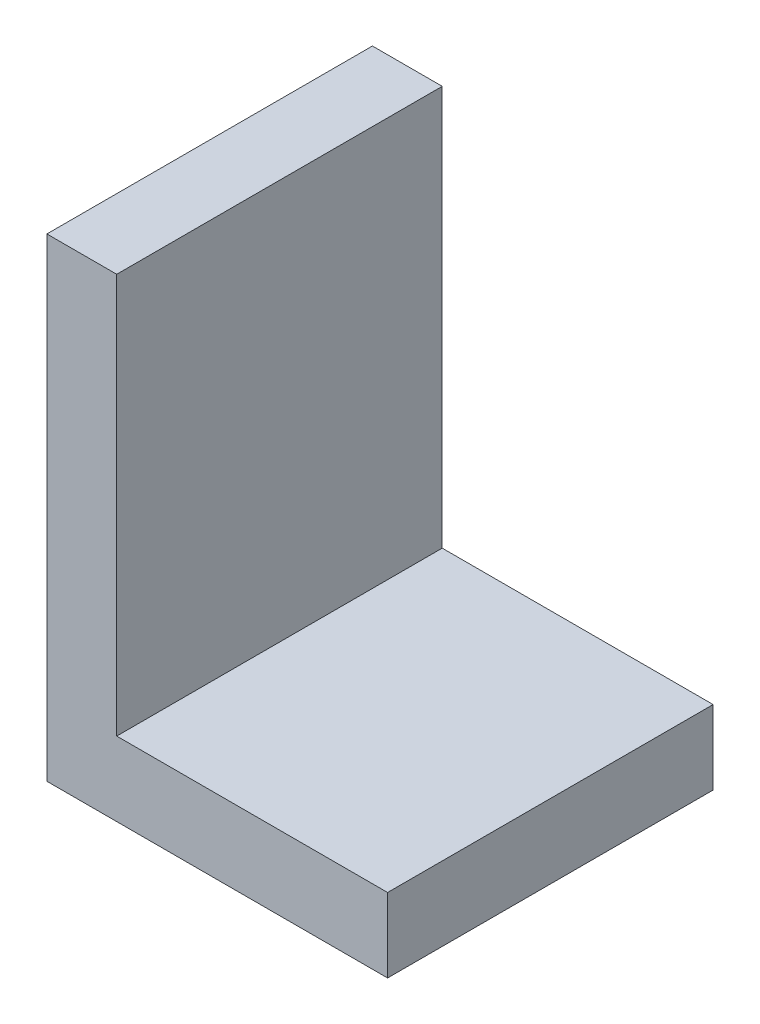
ISO-10303-21;
HEADER;
FILE_DESCRIPTION(('STEP AP214'),'2;1');
FILE_NAME('part.step','',(''),(''),'','','');
FILE_SCHEMA(('AUTOMOTIVE_DESIGN { 1 0 10303 214 1 1 1 1 }'));
ENDSEC;
DATA;
#1=APPLICATION_CONTEXT('core data for automotive mechanical design processes');
#2=APPLICATION_PROTOCOL_DEFINITION('international standard','automotive_design',2000,#1);
#3=PRODUCT_CONTEXT('',#1,'mechanical');
#4=PRODUCT('Part','Part','',(#3));
#5=PRODUCT_RELATED_PRODUCT_CATEGORY('part','',(#4));
#6=PRODUCT_DEFINITION_FORMATION('','',#4);
#7=PRODUCT_DEFINITION_CONTEXT('part definition',#1,'design');
#8=PRODUCT_DEFINITION('design','',#6,#7);
#9=PRODUCT_DEFINITION_SHAPE('','',#8);
#10=(LENGTH_UNIT() NAMED_UNIT(*) SI_UNIT(.MILLI.,.METRE.));
#11=(NAMED_UNIT(*) PLANE_ANGLE_UNIT() SI_UNIT($,.RADIAN.));
#12=(NAMED_UNIT(*) SI_UNIT($,.STERADIAN.) SOLID_ANGLE_UNIT());
#13=UNCERTAINTY_MEASURE_WITH_UNIT(LENGTH_MEASURE(1.E-05),#10,'distance_accuracy_value','');
#14=(GEOMETRIC_REPRESENTATION_CONTEXT(3) GLOBAL_UNCERTAINTY_ASSIGNED_CONTEXT((#13)) GLOBAL_UNIT_ASSIGNED_CONTEXT((#10,
#11,#12)) REPRESENTATION_CONTEXT('',''));
#15=CARTESIAN_POINT('',(0.,0.,0.));
#16=DIRECTION('',(0.,0.,1.));
#17=DIRECTION('',(1.,0.,0.));
#18=AXIS2_PLACEMENT_3D('',#15,#16,#17);
#19=CARTESIAN_POINT('',(68.3232713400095,0.,32.639));
#20=DIRECTION('',(0.,1.,0.));
#21=DIRECTION('',(0.,0.,1.));
#22=AXIS2_PLACEMENT_3D('',#19,#20,#21);
#23=PLANE('',#22);
#24=DIRECTION('',(1.,0.,0.));
#25=VECTOR('',#24,1.);
#26=CARTESIAN_POINT('',(68.3232713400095,0.,-32.639));
#27=LINE('',#26,#25);
#28=CARTESIAN_POINT('',(0.,0.,-32.639));
#29=VERTEX_POINT('',#28);
#30=CARTESIAN_POINT('',(68.3232713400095,0.,-32.639));
#31=VERTEX_POINT('',#30);
#32=EDGE_CURVE('E115',#29,#31,#27,.T.);
#33=ORIENTED_EDGE('',*,*,#32,.T.);
#34=DIRECTION('',(0.,0.,-1.));
#35=VECTOR('',#34,1.);
#36=CARTESIAN_POINT('',(68.3232713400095,0.,32.639));
#37=LINE('',#36,#35);
#38=CARTESIAN_POINT('',(68.3232713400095,0.,32.639));
#39=VERTEX_POINT('',#38);
#40=EDGE_CURVE('E11',#39,#31,#37,.T.);
#41=ORIENTED_EDGE('',*,*,#40,.F.);
#42=DIRECTION('',(1.,0.,0.));
#43=VECTOR('',#42,1.);
#44=CARTESIAN_POINT('',(68.3232713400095,0.,32.639));
#45=LINE('',#44,#43);
#46=CARTESIAN_POINT('',(0.,0.,32.639));
#47=VERTEX_POINT('',#46);
#48=EDGE_CURVE('E125',#47,#39,#45,.T.);
#49=ORIENTED_EDGE('',*,*,#48,.F.);
#50=DIRECTION('',(0.,0.,-1.));
#51=VECTOR('',#50,1.);
#52=CARTESIAN_POINT('',(0.,0.,32.639));
#53=LINE('',#52,#51);
#54=EDGE_CURVE('E111',#47,#29,#53,.T.);
#55=ORIENTED_EDGE('',*,*,#54,.T.);
#56=EDGE_LOOP('',(#33,#41,#49,#55));
#57=FACE_BOUND('',#56,.T.);
#58=ADVANCED_FACE('F31',(#57),#23,.F.);
#59=CARTESIAN_POINT('',(68.3232713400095,14.8528850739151,32.639));
#60=DIRECTION('',(-1.,0.,0.));
#61=DIRECTION('',(0.,0.,1.));
#62=AXIS2_PLACEMENT_3D('',#59,#60,#61);
#63=PLANE('',#62);
#64=DIRECTION('',(0.,1.,0.));
#65=VECTOR('',#64,1.);
#66=CARTESIAN_POINT('',(68.3232713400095,14.8528850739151,-32.639));
#67=LINE('',#66,#65);
#68=CARTESIAN_POINT('',(68.3232713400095,14.8528850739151,-32.639));
#69=VERTEX_POINT('',#68);
#70=EDGE_CURVE('E118',#31,#69,#67,.T.);
#71=ORIENTED_EDGE('',*,*,#70,.T.);
#72=DIRECTION('',(0.,0.,-1.));
#73=VECTOR('',#72,1.);
#74=CARTESIAN_POINT('',(68.3232713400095,14.8528850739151,32.639));
#75=LINE('',#74,#73);
#76=CARTESIAN_POINT('',(68.3232713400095,14.8528850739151,32.639));
#77=VERTEX_POINT('',#76);
#78=EDGE_CURVE('E39',#77,#69,#75,.T.);
#79=ORIENTED_EDGE('',*,*,#78,.F.);
#80=DIRECTION('',(0.,1.,0.));
#81=VECTOR('',#80,1.);
#82=CARTESIAN_POINT('',(68.3232713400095,14.8528850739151,32.639));
#83=LINE('',#82,#81);
#84=EDGE_CURVE('E84',#39,#77,#83,.T.);
#85=ORIENTED_EDGE('',*,*,#84,.F.);
#86=ORIENTED_EDGE('',*,*,#40,.T.);
#87=EDGE_LOOP('',(#71,#79,#85,#86));
#88=FACE_BOUND('',#87,.T.);
#89=ADVANCED_FACE('F149',(#88),#63,.F.);
#90=CARTESIAN_POINT('',(14.0041487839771,14.8528850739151,32.639));
#91=DIRECTION('',(0.,-1.,0.));
#92=DIRECTION('',(0.,0.,-1.));
#93=AXIS2_PLACEMENT_3D('',#90,#91,#92);
#94=PLANE('',#93);
#95=DIRECTION('',(-1.,0.,0.));
#96=VECTOR('',#95,1.);
#97=CARTESIAN_POINT('',(14.0041487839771,14.8528850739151,-32.639));
#98=LINE('',#97,#96);
#99=CARTESIAN_POINT('',(14.0041487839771,14.8528850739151,-32.639));
#100=VERTEX_POINT('',#99);
#101=EDGE_CURVE('E120',#69,#100,#98,.T.);
#102=ORIENTED_EDGE('',*,*,#101,.T.);
#103=DIRECTION('',(0.,0.,-1.));
#104=VECTOR('',#103,1.);
#105=CARTESIAN_POINT('',(14.0041487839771,14.8528850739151,32.639));
#106=LINE('',#105,#104);
#107=CARTESIAN_POINT('',(14.0041487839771,14.8528850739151,32.639));
#108=VERTEX_POINT('',#107);
#109=EDGE_CURVE('E106',#108,#100,#106,.T.);
#110=ORIENTED_EDGE('',*,*,#109,.F.);
#111=DIRECTION('',(-1.,0.,0.));
#112=VECTOR('',#111,1.);
#113=CARTESIAN_POINT('',(14.0041487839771,14.8528850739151,32.639));
#114=LINE('',#113,#112);
#115=EDGE_CURVE('E97',#77,#108,#114,.T.);
#116=ORIENTED_EDGE('',*,*,#115,.F.);
#117=ORIENTED_EDGE('',*,*,#78,.T.);
#118=EDGE_LOOP('',(#102,#110,#116,#117));
#119=FACE_BOUND('',#118,.T.);
#120=ADVANCED_FACE('F131',(#119),#94,.F.);
#121=CARTESIAN_POINT('',(14.0041487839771,95.0584644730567,32.639));
#122=DIRECTION('',(-1.,0.,0.));
#123=DIRECTION('',(0.,0.,1.));
#124=AXIS2_PLACEMENT_3D('',#121,#122,#123);
#125=PLANE('',#124);
#126=DIRECTION('',(0.,1.,0.));
#127=VECTOR('',#126,1.);
#128=CARTESIAN_POINT('',(14.0041487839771,95.0584644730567,-32.639));
#129=LINE('',#128,#127);
#130=CARTESIAN_POINT('',(14.0041487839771,95.0584644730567,-32.639));
#131=VERTEX_POINT('',#130);
#132=EDGE_CURVE('E105',#100,#131,#129,.T.);
#133=ORIENTED_EDGE('',*,*,#132,.T.);
#134=DIRECTION('',(0.,0.,-1.));
#135=VECTOR('',#134,1.);
#136=CARTESIAN_POINT('',(14.0041487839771,95.0584644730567,32.639));
#137=LINE('',#136,#135);
#138=CARTESIAN_POINT('',(14.0041487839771,95.0584644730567,32.639));
#139=VERTEX_POINT('',#138);
#140=EDGE_CURVE('E102',#139,#131,#137,.T.);
#141=ORIENTED_EDGE('',*,*,#140,.F.);
#142=DIRECTION('',(0.,1.,0.));
#143=VECTOR('',#142,1.);
#144=CARTESIAN_POINT('',(14.0041487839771,95.0584644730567,32.639));
#145=LINE('',#144,#143);
#146=EDGE_CURVE('E91',#108,#139,#145,.T.);
#147=ORIENTED_EDGE('',*,*,#146,.F.);
#148=ORIENTED_EDGE('',*,*,#109,.T.);
#149=EDGE_LOOP('',(#133,#141,#147,#148));
#150=FACE_BOUND('',#149,.T.);
#151=ADVANCED_FACE('F103',(#150),#125,.F.);
#152=CARTESIAN_POINT('',(0.,95.0584644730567,32.639));
#153=DIRECTION('',(0.,-1.,0.));
#154=DIRECTION('',(0.,0.,-1.));
#155=AXIS2_PLACEMENT_3D('',#152,#153,#154);
#156=PLANE('',#155);
#157=DIRECTION('',(-1.,0.,0.));
#158=VECTOR('',#157,1.);
#159=CARTESIAN_POINT('',(0.,95.0584644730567,-32.639));
#160=LINE('',#159,#158);
#161=CARTESIAN_POINT('',(0.,95.0584644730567,-32.639));
#162=VERTEX_POINT('',#161);
#163=EDGE_CURVE('E70',#131,#162,#160,.T.);
#164=ORIENTED_EDGE('',*,*,#163,.T.);
#165=DIRECTION('',(0.,0.,-1.));
#166=VECTOR('',#165,1.);
#167=CARTESIAN_POINT('',(0.,95.0584644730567,32.639));
#168=LINE('',#167,#166);
#169=CARTESIAN_POINT('',(0.,95.0584644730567,32.639));
#170=VERTEX_POINT('',#169);
#171=EDGE_CURVE('E107',#170,#162,#168,.T.);
#172=ORIENTED_EDGE('',*,*,#171,.F.);
#173=DIRECTION('',(-1.,0.,0.));
#174=VECTOR('',#173,1.);
#175=CARTESIAN_POINT('',(0.,95.0584644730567,32.639));
#176=LINE('',#175,#174);
#177=EDGE_CURVE('E95',#139,#170,#176,.T.);
#178=ORIENTED_EDGE('',*,*,#177,.F.);
#179=ORIENTED_EDGE('',*,*,#140,.T.);
#180=EDGE_LOOP('',(#164,#172,#178,#179));
#181=FACE_BOUND('',#180,.T.);
#182=ADVANCED_FACE('F109',(#181),#156,.F.);
#183=CARTESIAN_POINT('',(0.,0.,32.639));
#184=DIRECTION('',(1.,0.,0.));
#185=DIRECTION('',(0.,0.,-1.));
#186=AXIS2_PLACEMENT_3D('',#183,#184,#185);
#187=PLANE('',#186);
#188=DIRECTION('',(0.,-1.,0.));
#189=VECTOR('',#188,1.);
#190=CARTESIAN_POINT('',(0.,0.,-32.639));
#191=LINE('',#190,#189);
#192=EDGE_CURVE('E76',#162,#29,#191,.T.);
#193=ORIENTED_EDGE('',*,*,#192,.T.);
#194=ORIENTED_EDGE('',*,*,#54,.F.);
#195=DIRECTION('',(0.,-1.,0.));
#196=VECTOR('',#195,1.);
#197=CARTESIAN_POINT('',(0.,0.,32.639));
#198=LINE('',#197,#196);
#199=EDGE_CURVE('E47',#170,#47,#198,.T.);
#200=ORIENTED_EDGE('',*,*,#199,.F.);
#201=ORIENTED_EDGE('',*,*,#171,.T.);
#202=EDGE_LOOP('',(#193,#194,#200,#201));
#203=FACE_BOUND('',#202,.T.);
#204=ADVANCED_FACE('F138',(#203),#187,.F.);
#205=CARTESIAN_POINT('',(0.,0.,32.639));
#206=DIRECTION('',(0.,0.,-1.));
#207=DIRECTION('',(-1.,0.,0.));
#208=AXIS2_PLACEMENT_3D('',#205,#206,#207);
#209=PLANE('',#208);
#210=ORIENTED_EDGE('',*,*,#48,.T.);
#211=ORIENTED_EDGE('',*,*,#84,.T.);
#212=ORIENTED_EDGE('',*,*,#115,.T.);
#213=ORIENTED_EDGE('',*,*,#146,.T.);
#214=ORIENTED_EDGE('',*,*,#177,.T.);
#215=ORIENTED_EDGE('',*,*,#199,.T.);
#216=EDGE_LOOP('',(#210,#211,#212,#213,#214,#215));
#217=FACE_BOUND('',#216,.T.);
#218=ADVANCED_FACE('F93',(#217),#209,.F.);
#219=CARTESIAN_POINT('',(0.,0.,-32.639));
#220=DIRECTION('',(0.,0.,-1.));
#221=DIRECTION('',(-1.,0.,0.));
#222=AXIS2_PLACEMENT_3D('',#219,#220,#221);
#223=PLANE('',#222);
#224=ORIENTED_EDGE('',*,*,#32,.F.);
#225=ORIENTED_EDGE('',*,*,#192,.F.);
#226=ORIENTED_EDGE('',*,*,#163,.F.);
#227=ORIENTED_EDGE('',*,*,#132,.F.);
#228=ORIENTED_EDGE('',*,*,#101,.F.);
#229=ORIENTED_EDGE('',*,*,#70,.F.);
#230=EDGE_LOOP('',(#224,#225,#226,#227,#228,#229));
#231=FACE_BOUND('',#230,.T.);
#232=ADVANCED_FACE('F134',(#231),#223,.T.);
#233=CLOSED_SHELL('',(#58,#89,#120,#151,#182,#204,#218,#232));
#234=MANIFOLD_SOLID_BREP('B2',#233);
#235=ADVANCED_BREP_SHAPE_REPRESENTATION('',(#18,#234),#14);
#236=SHAPE_DEFINITION_REPRESENTATION(#9,#235);
ENDSEC;
END-ISO-10303-21;
